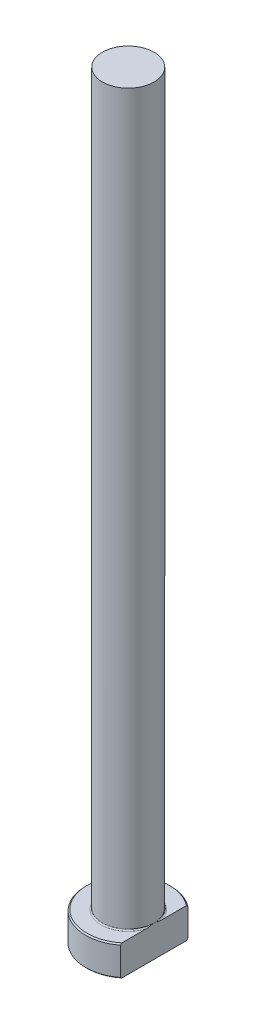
ISO-10303-21;
HEADER;
FILE_DESCRIPTION(('STEP AP214'),'2;1');
FILE_NAME('part.step','',(''),(''),'','','');
FILE_SCHEMA(('AUTOMOTIVE_DESIGN { 1 0 10303 214 1 1 1 1 }'));
ENDSEC;
DATA;
#1=APPLICATION_CONTEXT('core data for automotive mechanical design processes');
#2=APPLICATION_PROTOCOL_DEFINITION('international standard','automotive_design',2000,#1);
#3=PRODUCT_CONTEXT('',#1,'mechanical');
#4=PRODUCT('Part','Part','',(#3));
#5=PRODUCT_RELATED_PRODUCT_CATEGORY('part','',(#4));
#6=PRODUCT_DEFINITION_FORMATION('','',#4);
#7=PRODUCT_DEFINITION_CONTEXT('part definition',#1,'design');
#8=PRODUCT_DEFINITION('design','',#6,#7);
#9=PRODUCT_DEFINITION_SHAPE('','',#8);
#10=(LENGTH_UNIT() NAMED_UNIT(*) SI_UNIT(.MILLI.,.METRE.));
#11=(NAMED_UNIT(*) PLANE_ANGLE_UNIT() SI_UNIT($,.RADIAN.));
#12=(NAMED_UNIT(*) SI_UNIT($,.STERADIAN.) SOLID_ANGLE_UNIT());
#13=UNCERTAINTY_MEASURE_WITH_UNIT(LENGTH_MEASURE(1.E-05),#10,'distance_accuracy_value','');
#14=(GEOMETRIC_REPRESENTATION_CONTEXT(3) GLOBAL_UNCERTAINTY_ASSIGNED_CONTEXT((#13)) GLOBAL_UNIT_ASSIGNED_CONTEXT((#10,
#11,#12)) REPRESENTATION_CONTEXT('',''));
#15=CARTESIAN_POINT('',(0.,0.,0.));
#16=DIRECTION('',(0.,0.,1.));
#17=DIRECTION('',(1.,0.,0.));
#18=AXIS2_PLACEMENT_3D('',#15,#16,#17);
#19=CARTESIAN_POINT('',(0.,0.,0.));
#20=DIRECTION('',(0.,-1.,0.));
#21=DIRECTION('',(0.,0.,-1.));
#22=AXIS2_PLACEMENT_3D('',#19,#20,#21);
#23=PLANE('',#22);
#24=CARTESIAN_POINT('',(0.,0.,0.));
#25=DIRECTION('',(0.,-1.,0.));
#26=DIRECTION('',(0.,0.,-1.));
#27=AXIS2_PLACEMENT_3D('',#24,#25,#26);
#28=CIRCLE('',#27,6.8);
#29=CARTESIAN_POINT('',(4.24999999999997,0.,5.30824829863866));
#30=VERTEX_POINT('',#29);
#31=CARTESIAN_POINT('',(4.24999999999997,0.,-5.30824829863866));
#32=VERTEX_POINT('',#31);
#33=EDGE_CURVE('E98',#30,#32,#28,.T.);
#34=ORIENTED_EDGE('',*,*,#33,.T.);
#35=DIRECTION('',(0.,0.,1.));
#36=VECTOR('',#35,1.);
#37=CARTESIAN_POINT('',(4.24999999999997,0.,-5.56214886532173));
#38=LINE('',#37,#36);
#39=EDGE_CURVE('E83',#32,#30,#38,.T.);
#40=ORIENTED_EDGE('',*,*,#39,.T.);
#41=EDGE_LOOP('',(#34,#40));
#42=FACE_BOUND('',#41,.T.);
#43=ADVANCED_FACE('F32',(#42),#23,.T.);
#44=CARTESIAN_POINT('',(0.,259.958771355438,0.));
#45=DIRECTION('',(0.,1.,0.));
#46=DIRECTION('',(0.,0.,1.));
#47=AXIS2_PLACEMENT_3D('',#44,#45,#46);
#48=CYLINDRICAL_SURFACE('',#47,6.99999999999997);
#49=CARTESIAN_POINT('',(0.,4.80000000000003,0.));
#50=DIRECTION('',(0.,1.,0.));
#51=DIRECTION('',(0.,0.,1.));
#52=AXIS2_PLACEMENT_3D('',#49,#50,#51);
#53=CIRCLE('',#52,6.99999999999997);
#54=CARTESIAN_POINT('',(4.24999999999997,4.80000000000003,5.56214886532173));
#55=VERTEX_POINT('',#54);
#56=CARTESIAN_POINT('',(4.24999999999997,4.80000000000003,-5.56214886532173));
#57=VERTEX_POINT('',#56);
#58=EDGE_CURVE('E104',#55,#57,#53,.F.);
#59=ORIENTED_EDGE('',*,*,#58,.T.);
#60=DIRECTION('',(0.,-1.,0.));
#61=VECTOR('',#60,1.);
#62=CARTESIAN_POINT('',(4.24999999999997,125.,-5.56214886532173));
#63=LINE('',#62,#61);
#64=CARTESIAN_POINT('',(4.24999999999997,0.199999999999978,-5.56214886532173));
#65=VERTEX_POINT('',#64);
#66=EDGE_CURVE('E183',#57,#65,#63,.T.);
#67=ORIENTED_EDGE('',*,*,#66,.T.);
#68=CARTESIAN_POINT('',(0.,0.199999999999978,0.));
#69=DIRECTION('',(0.,-1.,0.));
#70=DIRECTION('',(0.,0.,-1.));
#71=AXIS2_PLACEMENT_3D('',#68,#69,#70);
#72=CIRCLE('',#71,6.99999999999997);
#73=CARTESIAN_POINT('',(4.24999999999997,0.199999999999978,5.56214886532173));
#74=VERTEX_POINT('',#73);
#75=EDGE_CURVE('E100',#65,#74,#72,.F.);
#76=ORIENTED_EDGE('',*,*,#75,.T.);
#77=DIRECTION('',(0.,-1.,0.));
#78=VECTOR('',#77,1.);
#79=CARTESIAN_POINT('',(4.24999999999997,125.,5.56214886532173));
#80=LINE('',#79,#78);
#81=EDGE_CURVE('E93',#55,#74,#80,.T.);
#82=ORIENTED_EDGE('',*,*,#81,.F.);
#83=EDGE_LOOP('',(#59,#67,#76,#82));
#84=FACE_BOUND('',#83,.T.);
#85=ADVANCED_FACE('F158',(#84),#48,.T.);
#86=CARTESIAN_POINT('',(-6.99999999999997,5.,0.));
#87=DIRECTION('',(0.,1.,0.));
#88=DIRECTION('',(0.,0.,1.));
#89=AXIS2_PLACEMENT_3D('',#86,#87,#88);
#90=PLANE('',#89);
#91=CARTESIAN_POINT('',(0.,5.,0.));
#92=DIRECTION('',(0.,1.,0.));
#93=DIRECTION('',(0.,0.,1.));
#94=AXIS2_PLACEMENT_3D('',#91,#92,#93);
#95=CIRCLE('',#94,6.79999999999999);
#96=CARTESIAN_POINT('',(4.24999999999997,5.,-5.30824829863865));
#97=VERTEX_POINT('',#96);
#98=CARTESIAN_POINT('',(4.24999999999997,5.,5.30824829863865));
#99=VERTEX_POINT('',#98);
#100=EDGE_CURVE('E178',#97,#99,#95,.T.);
#101=ORIENTED_EDGE('',*,*,#100,.T.);
#102=DIRECTION('',(0.,0.,-1.));
#103=VECTOR('',#102,1.);
#104=CARTESIAN_POINT('',(4.24999999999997,5.,0.));
#105=LINE('',#104,#103);
#106=CARTESIAN_POINT('',(4.24999999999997,4.99999999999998,1.31909059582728));
#107=VERTEX_POINT('',#106);
#108=EDGE_CURVE('E57',#99,#107,#105,.T.);
#109=ORIENTED_EDGE('',*,*,#108,.T.);
#110=CARTESIAN_POINT('',(0.,5.,0.));
#111=DIRECTION('',(0.,1.,0.));
#112=DIRECTION('',(0.,0.,1.));
#113=AXIS2_PLACEMENT_3D('',#110,#111,#112);
#114=CIRCLE('',#113,4.44999999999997);
#115=CARTESIAN_POINT('',(4.24999999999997,4.99999999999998,-1.31909059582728));
#116=VERTEX_POINT('',#115);
#117=EDGE_CURVE('E107',#107,#116,#114,.F.);
#118=ORIENTED_EDGE('',*,*,#117,.T.);
#119=EDGE_CURVE('E136',#116,#97,#105,.T.);
#120=ORIENTED_EDGE('',*,*,#119,.T.);
#121=EDGE_LOOP('',(#101,#109,#118,#120));
#122=FACE_BOUND('',#121,.T.);
#123=ADVANCED_FACE('F147',(#122),#90,.T.);
#124=CARTESIAN_POINT('',(0.,5.,0.));
#125=DIRECTION('',(0.,-1.,0.));
#126=DIRECTION('',(0.,0.,-1.));
#127=AXIS2_PLACEMENT_3D('',#124,#125,#126);
#128=CONICAL_SURFACE('',#127,6.79999999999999,0.785398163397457);
#129=ORIENTED_EDGE('',*,*,#58,.F.);
#130=CARTESIAN_POINT('',(4.24999999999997,-1.15497179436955,12.2380061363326));
#131=CARTESIAN_POINT('',(4.24999999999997,-0.968600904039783,12.0407126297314));
#132=CARTESIAN_POINT('',(4.24999999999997,-0.782481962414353,11.843180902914));
#133=CARTESIAN_POINT('',(4.24999999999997,-0.410835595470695,11.4475596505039));
#134=CARTESIAN_POINT('',(4.24999999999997,-0.225308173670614,11.2494701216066));
#135=CARTESIAN_POINT('',(4.24999999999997,0.330615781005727,10.6538566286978));
#136=CARTESIAN_POINT('',(4.24999999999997,0.699987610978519,10.2553749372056));
#137=CARTESIAN_POINT('',(4.24999999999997,1.44820689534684,9.44056382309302));
#138=CARTESIAN_POINT('',(4.24999999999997,1.82691721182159,9.02410803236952));
#139=CARTESIAN_POINT('',(4.24999999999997,2.39038838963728,8.39564122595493));
#140=CARTESIAN_POINT('',(4.24999999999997,2.57736390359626,8.1856164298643));
#141=CARTESIAN_POINT('',(4.24999999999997,2.94948531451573,7.76395344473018));
#142=CARTESIAN_POINT('',(4.24999999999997,3.13463122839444,7.55231527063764));
#143=CARTESIAN_POINT('',(4.24999999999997,3.50243810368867,7.12729701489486));
#144=CARTESIAN_POINT('',(4.24999999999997,3.68510158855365,6.91391912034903));
#145=CARTESIAN_POINT('',(4.24999999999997,4.04753998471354,6.48470257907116));
#146=CARTESIAN_POINT('',(4.24999999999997,4.22731476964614,6.26886382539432));
#147=CARTESIAN_POINT('',(4.24999999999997,4.58362310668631,5.83346482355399));
#148=CARTESIAN_POINT('',(4.24999999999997,4.76014565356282,5.61389554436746));
#149=CARTESIAN_POINT('',(4.24999999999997,5.10813954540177,5.1708154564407));
#150=CARTESIAN_POINT('',(4.24999999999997,5.27961153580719,4.94730515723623));
#151=CARTESIAN_POINT('',(4.24999999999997,5.61292794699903,4.49883470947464));
#152=CARTESIAN_POINT('',(4.24999999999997,5.77488381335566,4.27395773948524));
#153=CARTESIAN_POINT('',(4.24999999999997,6.08959034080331,3.81755429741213));
#154=CARTESIAN_POINT('',(4.24999999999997,6.2423352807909,3.58602382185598));
#155=CARTESIAN_POINT('',(4.24999999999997,6.46088242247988,3.2329692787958));
#156=CARTESIAN_POINT('',(4.24999999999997,6.53180994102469,3.11461948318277));
#157=CARTESIAN_POINT('',(4.24999999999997,6.66953191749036,2.87554671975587));
#158=CARTESIAN_POINT('',(4.24999999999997,6.73632692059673,2.7548240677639));
#159=CARTESIAN_POINT('',(4.24999999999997,6.86480050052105,2.51086229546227));
#160=CARTESIAN_POINT('',(4.24999999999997,6.92648531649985,2.38762647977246));
#161=CARTESIAN_POINT('',(4.24999999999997,7.04367856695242,2.13827051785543));
#162=CARTESIAN_POINT('',(4.24999999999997,7.09918867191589,2.0121511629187));
#163=CARTESIAN_POINT('',(4.24999999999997,7.20212054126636,1.75821381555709));
#164=CARTESIAN_POINT('',(4.24999999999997,7.24962333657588,1.63042897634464));
#165=CARTESIAN_POINT('',(4.24999999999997,7.33574687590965,1.37182854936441));
#166=CARTESIAN_POINT('',(4.24999999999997,7.37436534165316,1.24101219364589));
#167=CARTESIAN_POINT('',(4.24999999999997,7.44090399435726,0.977431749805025));
#168=CARTESIAN_POINT('',(4.24999999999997,7.46888314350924,0.844682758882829));
#169=CARTESIAN_POINT('',(4.24999999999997,7.51300819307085,0.577216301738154));
#170=CARTESIAN_POINT('',(4.24999999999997,7.52915548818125,0.44249906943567));
#171=CARTESIAN_POINT('',(4.24999999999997,7.54874331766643,0.170860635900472));
#172=CARTESIAN_POINT('',(4.24999999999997,7.55206380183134,0.0339306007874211));
#173=CARTESIAN_POINT('',(4.24999999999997,7.54544836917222,-0.239598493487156));
#174=CARTESIAN_POINT('',(4.24999999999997,7.53551276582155,-0.376197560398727));
#175=CARTESIAN_POINT('',(4.24999999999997,7.50295253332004,-0.648437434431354));
#176=CARTESIAN_POINT('',(4.24999999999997,7.48027427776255,-0.784071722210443));
#177=CARTESIAN_POINT('',(4.24999999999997,7.42348982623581,-1.05291460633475));
#178=CARTESIAN_POINT('',(4.24999999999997,7.38938084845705,-1.18612260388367));
#179=CARTESIAN_POINT('',(4.24999999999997,7.29188531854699,-1.51531404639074));
#180=CARTESIAN_POINT('',(4.24999999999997,7.2223807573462,-1.70947814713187));
#181=CARTESIAN_POINT('',(4.24999999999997,7.0666874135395,-2.09097599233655));
#182=CARTESIAN_POINT('',(4.24999999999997,6.98048657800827,-2.27830468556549));
#183=CARTESIAN_POINT('',(4.24999999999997,6.84149476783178,-2.55552751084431));
#184=CARTESIAN_POINT('',(4.24999999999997,6.79327931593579,-2.64776502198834));
#185=CARTESIAN_POINT('',(4.24999999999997,6.69413480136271,-2.83077431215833));
#186=CARTESIAN_POINT('',(4.24999999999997,6.64320570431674,-2.92154607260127));
#187=CARTESIAN_POINT('',(4.24999999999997,6.53904474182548,-3.10170103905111));
#188=CARTESIAN_POINT('',(4.24999999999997,6.48581387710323,-3.19108482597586));
#189=CARTESIAN_POINT('',(4.24999999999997,6.37734720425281,-3.36861867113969));
#190=CARTESIAN_POINT('',(4.24999999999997,6.32211148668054,-3.45676878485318));
#191=CARTESIAN_POINT('',(4.24999999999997,6.13027123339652,-3.75631659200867));
#192=CARTESIAN_POINT('',(4.24999999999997,5.9894700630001,-3.96503082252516));
#193=CARTESIAN_POINT('',(4.24999999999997,5.70061349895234,-4.37739745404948));
#194=CARTESIAN_POINT('',(4.24999999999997,5.55255625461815,-4.58104854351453));
#195=CARTESIAN_POINT('',(4.24999999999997,5.25096308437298,-4.98451036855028));
#196=CARTESIAN_POINT('',(4.24999999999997,5.0974225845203,-5.18431767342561));
#197=CARTESIAN_POINT('',(4.24999999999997,4.78630665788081,-5.58072220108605));
#198=CARTESIAN_POINT('',(4.24999999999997,4.62873161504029,-5.77731972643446));
#199=CARTESIAN_POINT('',(4.24999999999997,4.30987074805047,-6.16866624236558));
#200=CARTESIAN_POINT('',(4.24999999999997,4.1485735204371,-6.3634059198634));
#201=CARTESIAN_POINT('',(4.24999999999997,3.82349048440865,-6.75079948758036));
#202=CARTESIAN_POINT('',(4.24999999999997,3.65970462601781,-6.94345333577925));
#203=CARTESIAN_POINT('',(4.24999999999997,3.3302217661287,-7.3269546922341));
#204=CARTESIAN_POINT('',(4.24999999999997,3.1645257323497,-7.51780303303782));
#205=CARTESIAN_POINT('',(4.24999999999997,2.83151234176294,-7.89808083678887));
#206=CARTESIAN_POINT('',(4.24999999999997,2.66419497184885,-8.08751028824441));
#207=CARTESIAN_POINT('',(4.24999999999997,2.19674563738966,-8.6129983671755));
#208=CARTESIAN_POINT('',(4.24999999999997,1.89516668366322,-8.94776953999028));
#209=CARTESIAN_POINT('',(4.24999999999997,1.28890266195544,-9.61456394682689));
#210=CARTESIAN_POINT('',(4.24999999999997,0.984217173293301,-9.9465867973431));
#211=CARTESIAN_POINT('',(4.24999999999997,0.374739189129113,-10.6061264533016));
#212=CARTESIAN_POINT('',(4.24999999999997,0.0699631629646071,-10.9336584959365));
#213=CARTESIAN_POINT('',(4.24999999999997,-0.54131733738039,-11.5870007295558));
#214=CARTESIAN_POINT('',(4.24999999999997,-0.847821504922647,-11.9128112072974));
#215=CARTESIAN_POINT('',(4.24999999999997,-1.15497179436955,-12.2380061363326));
#216=B_SPLINE_CURVE_WITH_KNOTS('',3,(#130,#131,#132,#133,#134,#135,#136,#137,#138,#139,#140,
#141,#142,#143,#144,#145,#146,#147,#148,#149,#150,#151,#152,#153,#154,#155,#156,#157,#158,#159,
#160,#161,#162,#163,#164,#165,#166,#167,#168,#169,#170,#171,#172,#173,#174,#175,#176,#177,#178,
#179,#180,#181,#182,#183,#184,#185,#186,#187,#188,#189,#190,#191,#192,#193,#194,#195,#196,#197,
#198,#199,#200,#201,#202,#203,#204,#205,#206,#207,#208,#209,#210,#211,#212,#213,#214,#215),
.UNSPECIFIED.,.F.,.F.,(4,2,2,2,2,2,2,2,2,2,2,2,2,2,2,2,2,2,2,2,2,2,2,2,2,2,2,2,2,2,2,2,2,2,2,2,
2,2,2,2,2,2,4),(0.,0.814204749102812,1.62841433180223,3.25843263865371,4.94708916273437,
5.79066412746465,6.63423128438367,7.47686481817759,8.31953511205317,9.16466757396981,
10.0096915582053,10.8409260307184,11.6726715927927,12.0865355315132,12.5003447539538,
12.9136410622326,13.3268252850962,13.7355380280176,14.144355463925,14.5508730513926,
14.9573427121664,15.3676075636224,15.7778627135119,16.1898574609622,16.6019525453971,
17.2195383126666,17.8375715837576,18.1497730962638,18.4619785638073,18.7740496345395,
19.0861066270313,19.8411596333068,20.5964062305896,21.352298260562,22.1081186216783,
22.8666854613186,23.6252675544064,24.3834808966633,25.1417003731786,26.4934084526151,
27.8453020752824,29.1874909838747,30.5294487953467),.UNSPECIFIED.);
#217=EDGE_CURVE('E135',#55,#99,#216,.T.);
#218=ORIENTED_EDGE('',*,*,#217,.T.);
#219=ORIENTED_EDGE('',*,*,#100,.F.);
#220=EDGE_CURVE('E127',#97,#57,#216,.T.);
#221=ORIENTED_EDGE('',*,*,#220,.T.);
#222=EDGE_LOOP('',(#129,#218,#219,#221));
#223=FACE_BOUND('',#222,.T.);
#224=ADVANCED_FACE('F143',(#223),#128,.T.);
#225=CARTESIAN_POINT('',(0.,0.199999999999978,0.));
#226=DIRECTION('',(0.,1.,0.));
#227=DIRECTION('',(0.,0.,1.));
#228=AXIS2_PLACEMENT_3D('',#225,#226,#227);
#229=CONICAL_SURFACE('',#228,6.99999999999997,0.785398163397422);
#230=ORIENTED_EDGE('',*,*,#75,.F.);
#231=CARTESIAN_POINT('',(4.24999999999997,6.15497179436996,-12.2380061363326));
#232=CARTESIAN_POINT('',(4.24999999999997,5.96860090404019,-12.0407126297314));
#233=CARTESIAN_POINT('',(4.24999999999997,5.78248196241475,-11.843180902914));
#234=CARTESIAN_POINT('',(4.24999999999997,5.41083559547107,-11.4475596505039));
#235=CARTESIAN_POINT('',(4.24999999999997,5.22530817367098,-11.2494701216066));
#236=CARTESIAN_POINT('',(4.24999999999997,4.66938421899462,-10.6538566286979));
#237=CARTESIAN_POINT('',(4.24999999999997,4.3000123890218,-10.2553749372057));
#238=CARTESIAN_POINT('',(4.24999999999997,3.55179310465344,-9.44056382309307));
#239=CARTESIAN_POINT('',(4.24999999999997,3.17308278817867,-9.02410803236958));
#240=CARTESIAN_POINT('',(4.24999999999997,2.60961161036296,-8.39564122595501));
#241=CARTESIAN_POINT('',(4.24999999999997,2.42263609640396,-8.18561642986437));
#242=CARTESIAN_POINT('',(4.24999999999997,2.05051468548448,-7.76395344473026));
#243=CARTESIAN_POINT('',(4.24999999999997,1.86536877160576,-7.55231527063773));
#244=CARTESIAN_POINT('',(4.24999999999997,1.49756189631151,-7.12729701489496));
#245=CARTESIAN_POINT('',(4.24999999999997,1.31489841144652,-6.91391912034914));
#246=CARTESIAN_POINT('',(4.24999999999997,0.95246001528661,-6.48470257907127));
#247=CARTESIAN_POINT('',(4.24999999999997,0.772685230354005,-6.26886382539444));
#248=CARTESIAN_POINT('',(4.24999999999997,0.416376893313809,-5.83346482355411));
#249=CARTESIAN_POINT('',(4.24999999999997,0.239854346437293,-5.61389554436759));
#250=CARTESIAN_POINT('',(4.24999999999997,-0.108139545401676,-5.17081545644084));
#251=CARTESIAN_POINT('',(4.24999999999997,-0.279611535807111,-4.94730515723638));
#252=CARTESIAN_POINT('',(4.24999999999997,-0.612927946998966,-4.49883470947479));
#253=CARTESIAN_POINT('',(4.24999999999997,-0.77488381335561,-4.2739577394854));
#254=CARTESIAN_POINT('',(4.24999999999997,-1.08959034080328,-3.8175542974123));
#255=CARTESIAN_POINT('',(4.24999999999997,-1.24233528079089,-3.58602382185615));
#256=CARTESIAN_POINT('',(4.24999999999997,-1.46088242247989,-3.23296927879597));
#257=CARTESIAN_POINT('',(4.24999999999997,-1.5318099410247,-3.11461948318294));
#258=CARTESIAN_POINT('',(4.24999999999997,-1.66953191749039,-2.87554671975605));
#259=CARTESIAN_POINT('',(4.24999999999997,-1.73632692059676,-2.75482406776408));
#260=CARTESIAN_POINT('',(4.24999999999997,-1.8648005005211,-2.51086229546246));
#261=CARTESIAN_POINT('',(4.24999999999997,-1.92648531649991,-2.38762647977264));
#262=CARTESIAN_POINT('',(4.24999999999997,-2.04367856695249,-2.13827051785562));
#263=CARTESIAN_POINT('',(4.24999999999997,-2.09918867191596,-2.0121511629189));
#264=CARTESIAN_POINT('',(4.24999999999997,-2.20212054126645,-1.75821381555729));
#265=CARTESIAN_POINT('',(4.24999999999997,-2.24962333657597,-1.63042897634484));
#266=CARTESIAN_POINT('',(4.24999999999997,-2.33574687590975,-1.37182854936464));
#267=CARTESIAN_POINT('',(4.24999999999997,-2.37436534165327,-1.24101219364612));
#268=CARTESIAN_POINT('',(4.24999999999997,-2.44090399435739,-0.977431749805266));
#269=CARTESIAN_POINT('',(4.24999999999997,-2.46888314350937,-0.844682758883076));
#270=CARTESIAN_POINT('',(4.24999999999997,-2.51300819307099,-0.577216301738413));
#271=CARTESIAN_POINT('',(4.24999999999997,-2.52915548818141,-0.442499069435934));
#272=CARTESIAN_POINT('',(4.24999999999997,-2.54874331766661,-0.170860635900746));
#273=CARTESIAN_POINT('',(4.24999999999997,-2.55206380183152,-0.0339306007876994));
#274=CARTESIAN_POINT('',(4.24999999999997,-2.54544836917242,0.23959849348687));
#275=CARTESIAN_POINT('',(4.24999999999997,-2.53551276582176,0.376197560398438));
#276=CARTESIAN_POINT('',(4.24999999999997,-2.50295253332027,0.64843743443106));
#277=CARTESIAN_POINT('',(4.24999999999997,-2.48027427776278,0.784071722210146));
#278=CARTESIAN_POINT('',(4.24999999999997,-2.42348982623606,1.05291460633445));
#279=CARTESIAN_POINT('',(4.24999999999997,-2.3893808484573,1.18612260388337));
#280=CARTESIAN_POINT('',(4.24999999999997,-2.29188531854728,1.5153140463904));
#281=CARTESIAN_POINT('',(4.24999999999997,-2.2223807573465,1.70947814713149));
#282=CARTESIAN_POINT('',(4.24999999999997,-2.06668741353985,2.0909759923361));
#283=CARTESIAN_POINT('',(4.24999999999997,-1.98048657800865,2.278304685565));
#284=CARTESIAN_POINT('',(4.24999999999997,-1.84149476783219,2.55552751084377));
#285=CARTESIAN_POINT('',(4.24999999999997,-1.79327931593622,2.64776502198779));
#286=CARTESIAN_POINT('',(4.24999999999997,-1.69413480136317,2.83077431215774));
#287=CARTESIAN_POINT('',(4.24999999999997,-1.64320570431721,2.92154607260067));
#288=CARTESIAN_POINT('',(4.24999999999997,-1.53904474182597,3.10170103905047));
#289=CARTESIAN_POINT('',(4.24999999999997,-1.48581387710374,3.19108482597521));
#290=CARTESIAN_POINT('',(4.24999999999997,-1.37734720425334,3.368618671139));
#291=CARTESIAN_POINT('',(4.24999999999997,-1.32211148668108,3.45676878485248));
#292=CARTESIAN_POINT('',(4.24999999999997,-1.13027123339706,3.75631659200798));
#293=CARTESIAN_POINT('',(4.24999999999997,-0.989470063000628,3.9650308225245));
#294=CARTESIAN_POINT('',(4.24999999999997,-0.700613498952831,4.37739745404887));
#295=CARTESIAN_POINT('',(4.24999999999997,-0.552556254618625,4.58104854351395));
#296=CARTESIAN_POINT('',(4.24999999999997,-0.25096308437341,4.98451036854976));
#297=CARTESIAN_POINT('',(4.24999999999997,-0.097422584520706,5.1843176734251));
#298=CARTESIAN_POINT('',(4.24999999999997,0.213693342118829,5.58072220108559));
#299=CARTESIAN_POINT('',(4.24999999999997,0.371268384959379,5.77731972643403));
#300=CARTESIAN_POINT('',(4.24999999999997,0.690129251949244,6.1686662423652));
#301=CARTESIAN_POINT('',(4.24999999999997,0.851426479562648,6.36340591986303));
#302=CARTESIAN_POINT('',(4.24999999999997,1.17650951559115,6.75079948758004));
#303=CARTESIAN_POINT('',(4.24999999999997,1.34029537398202,6.94345333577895));
#304=CARTESIAN_POINT('',(4.24999999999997,1.66977823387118,7.32695469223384));
#305=CARTESIAN_POINT('',(4.24999999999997,1.83547426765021,7.51780303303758));
#306=CARTESIAN_POINT('',(4.24999999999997,2.16848765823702,7.89808083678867));
#307=CARTESIAN_POINT('',(4.24999999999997,2.33580502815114,8.08751028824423));
#308=CARTESIAN_POINT('',(4.24999999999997,2.8032543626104,8.61299836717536));
#309=CARTESIAN_POINT('',(4.24999999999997,3.10483331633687,8.94776953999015));
#310=CARTESIAN_POINT('',(4.24999999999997,3.71109733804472,9.61456394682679));
#311=CARTESIAN_POINT('',(4.24999999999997,4.01578282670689,9.94658679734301));
#312=CARTESIAN_POINT('',(4.24999999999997,4.62526081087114,10.6061264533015));
#313=CARTESIAN_POINT('',(4.24999999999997,4.93003683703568,10.9336584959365));
#314=CARTESIAN_POINT('',(4.24999999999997,5.54131733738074,11.5870007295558));
#315=CARTESIAN_POINT('',(4.24999999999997,5.84782150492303,11.9128112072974));
#316=CARTESIAN_POINT('',(4.24999999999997,6.15497179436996,12.2380061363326));
#317=B_SPLINE_CURVE_WITH_KNOTS('',3,(#231,#232,#233,#234,#235,#236,#237,#238,#239,#240,#241,
#242,#243,#244,#245,#246,#247,#248,#249,#250,#251,#252,#253,#254,#255,#256,#257,#258,#259,#260,
#261,#262,#263,#264,#265,#266,#267,#268,#269,#270,#271,#272,#273,#274,#275,#276,#277,#278,#279,
#280,#281,#282,#283,#284,#285,#286,#287,#288,#289,#290,#291,#292,#293,#294,#295,#296,#297,#298,
#299,#300,#301,#302,#303,#304,#305,#306,#307,#308,#309,#310,#311,#312,#313,#314,#315,#316),
.UNSPECIFIED.,.F.,.F.,(4,2,2,2,2,2,2,2,2,2,2,2,2,2,2,2,2,2,2,2,2,2,2,2,2,2,2,2,2,2,2,2,2,2,2,2,
2,2,2,2,2,2,4),(0.,0.814204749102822,1.62841433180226,3.25843263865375,4.94708916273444,
5.79066412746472,6.63423128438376,7.47686481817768,8.31953511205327,9.16466757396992,
10.0096915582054,10.8409260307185,11.6726715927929,12.0865355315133,12.500344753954,
12.9136410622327,13.3268252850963,13.7355380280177,14.1443554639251,14.5508730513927,
14.9573427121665,15.3676075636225,15.777862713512,16.1898574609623,16.6019525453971,
17.2195383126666,17.8375715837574,18.1497730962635,18.461978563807,18.7740496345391,
19.0861066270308,19.8411596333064,20.5964062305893,21.3522982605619,22.1081186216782,
22.8666854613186,23.6252675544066,24.3834808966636,25.141700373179,26.4934084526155,
27.845302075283,29.1874909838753,30.5294487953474),.UNSPECIFIED.);
#318=EDGE_CURVE('E86',#65,#32,#317,.T.);
#319=ORIENTED_EDGE('',*,*,#318,.T.);
#320=ORIENTED_EDGE('',*,*,#33,.F.);
#321=EDGE_CURVE('E89',#30,#74,#317,.T.);
#322=ORIENTED_EDGE('',*,*,#321,.T.);
#323=EDGE_LOOP('',(#230,#319,#320,#322));
#324=FACE_BOUND('',#323,.T.);
#325=ADVANCED_FACE('F97',(#324),#229,.T.);
#326=CARTESIAN_POINT('',(0.,5.19999999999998,0.));
#327=DIRECTION('',(0.,1.,0.));
#328=DIRECTION('',(0.,0.,1.));
#329=AXIS2_PLACEMENT_3D('',#326,#327,#328);
#330=TOROIDAL_SURFACE('',#329,4.44999999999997,0.2);
#331=CARTESIAN_POINT('',(4.24999999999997,5.19999999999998,0.));
#332=CARTESIAN_POINT('',(4.24999999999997,5.20000051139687,1.15744821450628E-10));
#333=CARTESIAN_POINT('',(4.24999999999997,5.20000102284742,-2.4293169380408E-07));
#334=CARTESIAN_POINT('',(4.24999999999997,5.20000197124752,-8.87321860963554E-07));
#335=CARTESIAN_POINT('',(4.24999999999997,5.20000238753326,-1.30614850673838E-06));
#336=CARTESIAN_POINT('',(4.24999999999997,5.20000327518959,-2.31752643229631E-06));
#337=CARTESIAN_POINT('',(4.24999999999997,5.20000373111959,-2.92646131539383E-06));
#338=CARTESIAN_POINT('',(4.24999999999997,5.200004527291,-4.16981951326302E-06));
#339=CARTESIAN_POINT('',(4.24999999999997,5.2000048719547,-4.80170872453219E-06));
#340=CARTESIAN_POINT('',(4.24999999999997,5.20000620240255,-7.3194814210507E-06));
#341=CARTESIAN_POINT('',(4.24999999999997,5.20000712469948,-9.24257745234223E-06));
#342=CARTESIAN_POINT('',(4.24999999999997,5.20000859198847,-1.29952261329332E-05));
#343=CARTESIAN_POINT('',(4.24999999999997,5.20000916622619,-1.48137375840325E-05));
#344=CARTESIAN_POINT('',(4.24999999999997,5.20001166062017,-2.2701068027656E-05));
#345=CARTESIAN_POINT('',(4.24999999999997,5.20001358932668,-2.87689532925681E-05));
#346=CARTESIAN_POINT('',(4.24999999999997,5.20001634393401,-4.00958698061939E-05));
#347=CARTESIAN_POINT('',(4.24999999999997,5.20001729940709,-4.53228601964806E-05));
#348=CARTESIAN_POINT('',(4.24999999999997,5.20002438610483,-8.47086375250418E-05));
#349=CARTESIAN_POINT('',(4.24999999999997,5.20002990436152,-0.000118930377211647));
#350=CARTESIAN_POINT('',(4.24999999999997,5.20005405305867,-0.000255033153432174));
#351=CARTESIAN_POINT('',(4.24999999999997,5.20007694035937,-0.00035616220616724));
#352=CARTESIAN_POINT('',(4.24999999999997,5.20016675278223,-0.000759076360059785));
#353=CARTESIAN_POINT('',(4.24999999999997,5.20023104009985,-0.00106124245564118));
#354=CARTESIAN_POINT('',(4.24999999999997,5.20048990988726,-0.00226975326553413));
#355=CARTESIAN_POINT('',(4.24999999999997,5.20068789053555,-0.00317558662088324));
#356=CARTESIAN_POINT('',(4.24999999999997,5.20151472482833,-0.00696787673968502));
#357=CARTESIAN_POINT('',(4.24999999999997,5.2021393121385,-0.00985497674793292));
#358=CARTESIAN_POINT('',(4.24999999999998,5.21047485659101,-0.0483744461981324));
#359=CARTESIAN_POINT('',(4.24999999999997,5.21821166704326,-0.0840032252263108));
#360=CARTESIAN_POINT('',(4.24999999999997,5.23443934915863,-0.15925743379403));
#361=CARTESIAN_POINT('',(4.24999999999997,5.24291807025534,-0.198885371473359));
#362=CARTESIAN_POINT('',(4.24999999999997,5.25719269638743,-0.266483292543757));
#363=CARTESIAN_POINT('',(4.24999999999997,5.2630418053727,-0.294441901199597));
#364=CARTESIAN_POINT('',(4.24999999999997,5.27443459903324,-0.349631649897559));
#365=CARTESIAN_POINT('',(4.24999999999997,5.27998226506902,-0.37686197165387));
#366=CARTESIAN_POINT('',(4.24999999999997,5.29789349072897,-0.466265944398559));
#367=CARTESIAN_POINT('',(4.24999999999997,5.3098841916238,-0.528515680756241));
#368=CARTESIAN_POINT('',(4.24999999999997,5.33255488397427,-0.653873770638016));
#369=CARTESIAN_POINT('',(4.24999999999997,5.34322118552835,-0.716984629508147));
#370=CARTESIAN_POINT('',(4.24999999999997,5.36341886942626,-0.849542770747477));
#371=CARTESIAN_POINT('',(4.24999999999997,5.37274606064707,-0.919022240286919));
#372=CARTESIAN_POINT('',(4.24999999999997,5.38787342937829,-1.05816998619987));
#373=CARTESIAN_POINT('',(4.24999999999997,5.39368393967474,-1.12783709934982));
#374=CARTESIAN_POINT('',(4.24999999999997,5.40022105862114,-1.26519903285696));
#375=CARTESIAN_POINT('',(4.24999999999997,5.40110718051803,-1.33288413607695));
#376=CARTESIAN_POINT('',(4.24999999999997,5.39715260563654,-1.43372383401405));
#377=CARTESIAN_POINT('',(4.24999999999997,5.39498924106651,-1.46697561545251));
#378=CARTESIAN_POINT('',(4.24999999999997,5.38843757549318,-1.53323057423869));
#379=CARTESIAN_POINT('',(4.24999999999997,5.38405165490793,-1.56623397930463));
#380=CARTESIAN_POINT('',(4.24999999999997,5.37221191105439,-1.63225744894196));
#381=CARTESIAN_POINT('',(4.24999999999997,5.36471302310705,-1.665270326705));
#382=CARTESIAN_POINT('',(4.24999999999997,5.35002141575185,-1.71373529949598));
#383=CARTESIAN_POINT('',(4.24999999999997,5.3445543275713,-1.72970598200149));
#384=CARTESIAN_POINT('',(4.24999999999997,5.33212858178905,-1.76104662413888));
#385=CARTESIAN_POINT('',(4.24999999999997,5.32517291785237,-1.77641771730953));
#386=CARTESIAN_POINT('',(4.24999999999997,5.31157493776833,-1.80173413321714));
#387=CARTESIAN_POINT('',(4.24999999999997,5.30543892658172,-1.81194868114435));
#388=CARTESIAN_POINT('',(4.24999999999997,5.29187259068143,-1.83147712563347));
#389=CARTESIAN_POINT('',(4.24999999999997,5.28444659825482,-1.84079387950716));
#390=CARTESIAN_POINT('',(4.24999999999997,5.27165788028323,-1.8539962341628));
#391=CARTESIAN_POINT('',(4.24999999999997,5.26687308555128,-1.85843752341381));
#392=CARTESIAN_POINT('',(4.24999999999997,5.25674280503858,-1.86663816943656));
#393=CARTESIAN_POINT('',(4.24999999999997,5.25139780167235,-1.87039810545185));
#394=CARTESIAN_POINT('',(4.24999999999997,5.24121545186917,-1.87633128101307));
#395=CARTESIAN_POINT('',(4.24999999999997,5.23647607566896,-1.87867040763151));
#396=CARTESIAN_POINT('',(4.24999999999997,5.22667692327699,-1.88254109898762));
#397=CARTESIAN_POINT('',(4.24999999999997,5.22161755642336,-1.88407367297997));
#398=CARTESIAN_POINT('',(4.24999999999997,5.21125115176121,-1.88618376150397));
#399=CARTESIAN_POINT('',(4.24999999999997,5.20594232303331,-1.8867527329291));
#400=CARTESIAN_POINT('',(4.24999999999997,5.1953165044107,-1.88683483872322));
#401=CARTESIAN_POINT('',(4.24999999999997,5.18999951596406,-1.88634814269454));
#402=CARTESIAN_POINT('',(4.24999999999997,5.18024254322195,-1.88451305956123));
#403=CARTESIAN_POINT('',(4.24999999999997,5.17577879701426,-1.88328567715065));
#404=CARTESIAN_POINT('',(4.24999999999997,5.16708370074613,-1.88018632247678));
#405=CARTESIAN_POINT('',(4.24999999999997,5.16285244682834,-1.87831408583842));
#406=CARTESIAN_POINT('',(4.24999999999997,5.15236530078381,-1.8728422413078));
#407=CARTESIAN_POINT('',(4.24999999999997,5.14630821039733,-1.86886321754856));
#408=CARTESIAN_POINT('',(4.24999999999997,5.13488065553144,-1.8600173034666));
#409=CARTESIAN_POINT('',(4.24999999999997,5.12951236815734,-1.85514771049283));
#410=CARTESIAN_POINT('',(4.24999999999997,5.11550691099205,-1.84083719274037));
#411=CARTESIAN_POINT('',(4.24999999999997,5.10752788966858,-1.83075903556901));
#412=CARTESIAN_POINT('',(4.24999999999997,5.09305704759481,-1.80961650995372));
#413=CARTESIAN_POINT('',(4.24999999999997,5.08656786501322,-1.7985504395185));
#414=CARTESIAN_POINT('',(4.24999999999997,5.07270261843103,-1.77195183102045));
#415=CARTESIAN_POINT('',(4.24999999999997,5.06578110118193,-1.75618509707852));
#416=CARTESIAN_POINT('',(4.24999999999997,5.05343494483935,-1.72406513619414));
#417=CARTESIAN_POINT('',(4.24999999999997,5.04801326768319,-1.70771081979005));
#418=CARTESIAN_POINT('',(4.24999999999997,5.03828568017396,-1.67446840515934));
#419=CARTESIAN_POINT('',(4.24999999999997,5.03399373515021,-1.65757628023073));
#420=CARTESIAN_POINT('',(4.24999999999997,5.02638165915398,-1.62359857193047));
#421=CARTESIAN_POINT('',(4.24999999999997,5.02306049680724,-1.60651321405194));
#422=CARTESIAN_POINT('',(4.24999999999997,5.01554103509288,-1.56237813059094));
#423=CARTESIAN_POINT('',(4.24999999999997,5.01193061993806,-1.53522860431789));
#424=CARTESIAN_POINT('',(4.24999999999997,5.00624732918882,-1.48076491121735));
#425=CARTESIAN_POINT('',(4.24999999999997,5.00417529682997,-1.45345066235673));
#426=CARTESIAN_POINT('',(4.24999999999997,4.99980704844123,-1.37123328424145));
#427=CARTESIAN_POINT('',(4.24999999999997,4.99938405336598,-1.31623108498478));
#428=CARTESIAN_POINT('',(4.24999999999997,5.00195512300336,-1.20937484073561));
#429=CARTESIAN_POINT('',(4.24999999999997,5.00476235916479,-1.15751417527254));
#430=CARTESIAN_POINT('',(4.24999999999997,5.01274020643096,-1.05395255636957));
#431=CARTESIAN_POINT('',(4.24999999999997,5.0179120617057,-1.00225170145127));
#432=CARTESIAN_POINT('',(4.24999999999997,5.0318667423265,-0.883772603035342));
#433=CARTESIAN_POINT('',(4.24999999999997,5.04126554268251,-0.817068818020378));
#434=CARTESIAN_POINT('',(4.24999999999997,5.06248695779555,-0.68230638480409));
#435=CARTESIAN_POINT('',(4.24999999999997,5.0743654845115,-0.614256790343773));
#436=CARTESIAN_POINT('',(4.24999999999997,5.09582131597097,-0.499048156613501));
#437=CARTESIAN_POINT('',(4.24999999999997,5.10500357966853,-0.451814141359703));
#438=CARTESIAN_POINT('',(4.24999999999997,5.1237965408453,-0.357991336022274));
#439=CARTESIAN_POINT('',(4.24999999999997,5.13340116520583,-0.311401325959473));
#440=CARTESIAN_POINT('',(4.24999999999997,5.15180561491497,-0.223687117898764));
#441=CARTESIAN_POINT('',(4.24999999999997,5.16056968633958,-0.182555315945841));
#442=CARTESIAN_POINT('',(4.24999999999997,5.178640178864,-0.0985301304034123));
#443=CARTESIAN_POINT('',(4.24999999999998,5.18795357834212,-0.0556381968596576));
#444=CARTESIAN_POINT('',(4.24999999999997,5.1978622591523,-0.00984762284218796));
#445=CARTESIAN_POINT('',(4.24999999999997,5.19848844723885,-0.00695317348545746));
#446=CARTESIAN_POINT('',(4.24999999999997,5.1993156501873,-0.00315924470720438));
#447=CARTESIAN_POINT('',(4.24999999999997,5.19951238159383,-0.00225911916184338));
#448=CARTESIAN_POINT('',(4.24999999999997,5.19976973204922,-0.00105770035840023));
#449=CARTESIAN_POINT('',(4.24999999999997,5.19983372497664,-0.000756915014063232));
#450=CARTESIAN_POINT('',(4.24999999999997,5.19992318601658,-0.000355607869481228));
#451=CARTESIAN_POINT('',(4.24999999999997,5.19994602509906,-0.000254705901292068));
#452=CARTESIAN_POINT('',(4.24999999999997,5.1999701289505,-0.000118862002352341));
#453=CARTESIAN_POINT('',(4.24999999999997,5.19997564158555,-8.4670569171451E-05));
#454=CARTESIAN_POINT('',(4.24999999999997,5.19998271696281,-4.53159337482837E-05));
#455=CARTESIAN_POINT('',(4.24999999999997,5.19998367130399,-4.00904844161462E-05));
#456=CARTESIAN_POINT('',(4.24999999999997,5.19998642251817,-2.87668536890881E-05));
#457=CARTESIAN_POINT('',(4.24999999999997,5.19998834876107,-2.27006335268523E-05));
#458=CARTESIAN_POINT('',(4.24999999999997,5.19999084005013,-1.48150638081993E-05));
#459=CARTESIAN_POINT('',(4.24999999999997,5.199991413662,-1.29966656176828E-05));
#460=CARTESIAN_POINT('',(4.24999999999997,5.19999287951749,-9.24415318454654E-06));
#461=CARTESIAN_POINT('',(4.24999999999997,5.19999380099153,-7.32106390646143E-06));
#462=CARTESIAN_POINT('',(4.24999999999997,5.19999513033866,-4.8031966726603E-06));
#463=CARTESIAN_POINT('',(4.24999999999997,5.19999547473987,-4.17124743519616E-06));
#464=CARTESIAN_POINT('',(4.24999999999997,5.19999627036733,-2.92772184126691E-06));
#465=CARTESIAN_POINT('',(4.24999999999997,5.19999672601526,-2.31867707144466E-06));
#466=CARTESIAN_POINT('',(4.24999999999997,5.19999761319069,-1.30704757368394E-06));
#467=CARTESIAN_POINT('',(4.24999999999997,5.19999802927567,-8.88090030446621E-07));
#468=CARTESIAN_POINT('',(4.24999999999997,5.19999897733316,-2.43359811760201E-07));
#469=CARTESIAN_POINT('',(4.24999999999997,5.19999948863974,-1.15736528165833E-10));
#470=CARTESIAN_POINT('',(4.24999999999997,5.19999999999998,0.));
#471=B_SPLINE_CURVE_WITH_KNOTS('',3,(#331,#332,#333,#334,#335,#336,#337,#338,#339,#340,#341,
#342,#343,#344,#345,#346,#347,#348,#349,#350,#351,#352,#353,#354,#355,#356,#357,#358,#359,#360,
#361,#362,#363,#364,#365,#366,#367,#368,#369,#370,#371,#372,#373,#374,#375,#376,#377,#378,#379,
#380,#381,#382,#383,#384,#385,#386,#387,#388,#389,#390,#391,#392,#393,#394,#395,#396,#397,#398,
#399,#400,#401,#402,#403,#404,#405,#406,#407,#408,#409,#410,#411,#412,#413,#414,#415,#416,#417,
#418,#419,#420,#421,#422,#423,#424,#425,#426,#427,#428,#429,#430,#431,#432,#433,#434,#435,#436,
#437,#438,#439,#440,#441,#442,#443,#444,#445,#446,#447,#448,#449,#450,#451,#452,#453,#454,#455,
#456,#457,#458,#459,#460,#461,#462,#463,#464,#465,#466,#467,#468,#469,#470),.UNSPECIFIED.,.T.,
.F.,(4,2,2,2,2,2,2,2,2,2,2,2,2,2,2,2,2,2,2,2,2,2,2,2,2,2,2,2,2,2,2,2,2,2,2,2,2,2,2,2,2,2,2,2,2,
2,2,2,2,2,2,2,2,2,2,2,2,2,2,2,2,2,2,2,2,2,2,2,2,4),(0.,1.56348638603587E-06,
3.34736003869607E-06,5.61252474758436E-06,7.7714730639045E-06,1.41498338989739E-05,
1.98654803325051E-05,3.89412506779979E-05,5.48646730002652E-05,0.000158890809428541,
0.000469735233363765,0.00139675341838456,0.00417812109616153,0.0130401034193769,
0.122414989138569,0.243989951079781,0.329681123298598,0.413050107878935,0.603220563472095,
0.795216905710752,1.00545960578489,1.21508152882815,1.41787186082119,1.51777979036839,
1.61758094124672,1.71888023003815,1.76947366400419,1.81996629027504,1.85565144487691,
1.89121899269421,1.91076085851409,1.93028603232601,1.94608264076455,1.9618594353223,
1.97777538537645,1.99368877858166,2.00752120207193,2.02135930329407,2.04297559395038,
2.06465860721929,2.10300421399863,2.14141720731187,2.19295510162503,2.24459405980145,
2.29684419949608,2.34903862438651,2.43114134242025,2.51328903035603,2.67811431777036,
2.83386590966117,2.98969954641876,3.19173551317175,3.39894587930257,3.54329728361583,
3.68600406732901,3.81216982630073,3.94384090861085,3.95272545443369,3.9554892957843,
3.9564120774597,3.95672222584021,3.95682615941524,3.95684207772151,3.95686114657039,
3.95686686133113,3.9568732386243,3.95687539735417,3.95687766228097,3.95687944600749,
3.95688100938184),.UNSPECIFIED.);
#472=CARTESIAN_POINT('',(4.24999999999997,5.19999999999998,0.));
#473=VERTEX_POINT('',#472);
#474=EDGE_CURVE('E11',#116,#473,#471,.T.);
#475=ORIENTED_EDGE('',*,*,#474,.F.);
#476=ORIENTED_EDGE('',*,*,#117,.F.);
#477=CARTESIAN_POINT('',(4.24999999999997,5.19999999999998,0.));
#478=CARTESIAN_POINT('',(4.24999999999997,5.1999994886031,-1.15744598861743E-10));
#479=CARTESIAN_POINT('',(4.24999999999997,5.19999897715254,2.42931693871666E-07));
#480=CARTESIAN_POINT('',(4.24999999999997,5.19999802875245,8.87321860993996E-07));
#481=CARTESIAN_POINT('',(4.24999999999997,5.1999976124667,1.30614850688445E-06));
#482=CARTESIAN_POINT('',(4.24999999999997,5.19999672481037,2.31752643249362E-06));
#483=CARTESIAN_POINT('',(4.24999999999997,5.19999626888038,2.92646131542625E-06));
#484=CARTESIAN_POINT('',(4.24999999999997,5.19999547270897,4.16981951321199E-06));
#485=CARTESIAN_POINT('',(4.24999999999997,5.19999512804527,4.8017087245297E-06));
#486=CARTESIAN_POINT('',(4.24999999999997,5.19999379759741,7.31948142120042E-06));
#487=CARTESIAN_POINT('',(4.24999999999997,5.19999287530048,9.24257745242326E-06));
#488=CARTESIAN_POINT('',(4.24999999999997,5.1999914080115,1.29952261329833E-05));
#489=CARTESIAN_POINT('',(4.24999999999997,5.19999083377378,1.48137375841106E-05));
#490=CARTESIAN_POINT('',(4.24999999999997,5.19998833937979,2.27010680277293E-05));
#491=CARTESIAN_POINT('',(4.24999999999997,5.19998641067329,2.87689532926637E-05));
#492=CARTESIAN_POINT('',(4.24999999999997,5.19998365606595,4.00958698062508E-05));
#493=CARTESIAN_POINT('',(4.24999999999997,5.19998270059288,4.53228601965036E-05));
#494=CARTESIAN_POINT('',(4.24999999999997,5.19997561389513,8.47086375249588E-05));
#495=CARTESIAN_POINT('',(4.24999999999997,5.19997009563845,0.000118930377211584));
#496=CARTESIAN_POINT('',(4.24999999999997,5.19994594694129,0.000255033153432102));
#497=CARTESIAN_POINT('',(4.24999999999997,5.1999230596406,0.000356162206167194));
#498=CARTESIAN_POINT('',(4.24999999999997,5.19983324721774,0.000759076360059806));
#499=CARTESIAN_POINT('',(4.24999999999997,5.19976895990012,0.00106124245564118));
#500=CARTESIAN_POINT('',(4.24999999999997,5.19951009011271,0.00226975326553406));
#501=CARTESIAN_POINT('',(4.24999999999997,5.19931210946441,0.00317558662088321));
#502=CARTESIAN_POINT('',(4.24999999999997,5.19848527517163,0.00696787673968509));
#503=CARTESIAN_POINT('',(4.24999999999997,5.19786068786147,0.00985497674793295));
#504=CARTESIAN_POINT('',(4.24999999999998,5.18952514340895,0.0483744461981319));
#505=CARTESIAN_POINT('',(4.24999999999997,5.1817883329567,0.0840032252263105));
#506=CARTESIAN_POINT('',(4.24999999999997,5.16556065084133,0.15925743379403));
#507=CARTESIAN_POINT('',(4.24999999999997,5.15708192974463,0.198885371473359));
#508=CARTESIAN_POINT('',(4.24999999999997,5.14280730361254,0.266483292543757));
#509=CARTESIAN_POINT('',(4.24999999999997,5.13695819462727,0.294441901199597));
#510=CARTESIAN_POINT('',(4.24999999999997,5.12556540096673,0.349631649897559));
#511=CARTESIAN_POINT('',(4.24999999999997,5.12001773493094,0.37686197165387));
#512=CARTESIAN_POINT('',(4.24999999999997,5.10210650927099,0.466265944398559));
#513=CARTESIAN_POINT('',(4.24999999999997,5.09011580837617,0.528515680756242));
#514=CARTESIAN_POINT('',(4.24999999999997,5.0674451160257,0.653873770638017));
#515=CARTESIAN_POINT('',(4.24999999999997,5.05677881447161,0.716984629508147));
#516=CARTESIAN_POINT('',(4.24999999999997,5.0365811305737,0.849542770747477));
#517=CARTESIAN_POINT('',(4.24999999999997,5.0272539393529,0.919022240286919));
#518=CARTESIAN_POINT('',(4.24999999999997,5.01212657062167,1.05816998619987));
#519=CARTESIAN_POINT('',(4.24999999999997,5.00631606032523,1.12783709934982));
#520=CARTESIAN_POINT('',(4.24999999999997,4.99977894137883,1.26519903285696));
#521=CARTESIAN_POINT('',(4.24999999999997,4.99889281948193,1.33288413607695));
#522=CARTESIAN_POINT('',(4.24999999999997,5.00284739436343,1.43372383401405));
#523=CARTESIAN_POINT('',(4.24999999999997,5.00501075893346,1.46697561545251));
#524=CARTESIAN_POINT('',(4.24999999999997,5.01156242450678,1.53323057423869));
#525=CARTESIAN_POINT('',(4.24999999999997,5.01594834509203,1.56623397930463));
#526=CARTESIAN_POINT('',(4.24999999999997,5.02778808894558,1.63225744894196));
#527=CARTESIAN_POINT('',(4.24999999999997,5.03528697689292,1.665270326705));
#528=CARTESIAN_POINT('',(4.24999999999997,5.04997858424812,1.71373529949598));
#529=CARTESIAN_POINT('',(4.24999999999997,5.05544567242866,1.72970598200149));
#530=CARTESIAN_POINT('',(4.24999999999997,5.06787141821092,1.76104662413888));
#531=CARTESIAN_POINT('',(4.24999999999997,5.0748270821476,1.77641771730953));
#532=CARTESIAN_POINT('',(4.24999999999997,5.08842506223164,1.80173413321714));
#533=CARTESIAN_POINT('',(4.24999999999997,5.09456107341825,1.81194868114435));
#534=CARTESIAN_POINT('',(4.24999999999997,5.10812740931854,1.83147712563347));
#535=CARTESIAN_POINT('',(4.24999999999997,5.11555340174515,1.84079387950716));
#536=CARTESIAN_POINT('',(4.24999999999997,5.12834211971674,1.8539962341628));
#537=CARTESIAN_POINT('',(4.24999999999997,5.13312691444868,1.85843752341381));
#538=CARTESIAN_POINT('',(4.24999999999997,5.14325719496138,1.86663816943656));
#539=CARTESIAN_POINT('',(4.24999999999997,5.14860219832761,1.87039810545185));
#540=CARTESIAN_POINT('',(4.24999999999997,5.15878454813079,1.87633128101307));
#541=CARTESIAN_POINT('',(4.24999999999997,5.16352392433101,1.87867040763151));
#542=CARTESIAN_POINT('',(4.24999999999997,5.17332307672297,1.88254109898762));
#543=CARTESIAN_POINT('',(4.24999999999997,5.17838244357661,1.88407367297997));
#544=CARTESIAN_POINT('',(4.24999999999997,5.18874884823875,1.88618376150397));
#545=CARTESIAN_POINT('',(4.24999999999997,5.19405767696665,1.8867527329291));
#546=CARTESIAN_POINT('',(4.24999999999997,5.20468349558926,1.88683483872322));
#547=CARTESIAN_POINT('',(4.24999999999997,5.2100004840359,1.88634814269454));
#548=CARTESIAN_POINT('',(4.24999999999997,5.21975745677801,1.88451305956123));
#549=CARTESIAN_POINT('',(4.24999999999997,5.2242212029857,1.88328567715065));
#550=CARTESIAN_POINT('',(4.24999999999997,5.23291629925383,1.88018632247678));
#551=CARTESIAN_POINT('',(4.24999999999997,5.23714755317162,1.87831408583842));
#552=CARTESIAN_POINT('',(4.24999999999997,5.24763469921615,1.8728422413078));
#553=CARTESIAN_POINT('',(4.24999999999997,5.25369178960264,1.86886321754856));
#554=CARTESIAN_POINT('',(4.24999999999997,5.26511934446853,1.8600173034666));
#555=CARTESIAN_POINT('',(4.24999999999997,5.27048763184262,1.85514771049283));
#556=CARTESIAN_POINT('',(4.24999999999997,5.28449308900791,1.84083719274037));
#557=CARTESIAN_POINT('',(4.24999999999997,5.29247211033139,1.83075903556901));
#558=CARTESIAN_POINT('',(4.24999999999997,5.30694295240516,1.80961650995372));
#559=CARTESIAN_POINT('',(4.24999999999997,5.31343213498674,1.7985504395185));
#560=CARTESIAN_POINT('',(4.24999999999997,5.32729738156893,1.77195183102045));
#561=CARTESIAN_POINT('',(4.24999999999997,5.33421889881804,1.75618509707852));
#562=CARTESIAN_POINT('',(4.24999999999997,5.34656505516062,1.72406513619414));
#563=CARTESIAN_POINT('',(4.24999999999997,5.35198673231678,1.70771081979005));
#564=CARTESIAN_POINT('',(4.24999999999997,5.361714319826,1.67446840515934));
#565=CARTESIAN_POINT('',(4.24999999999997,5.36600626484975,1.65757628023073));
#566=CARTESIAN_POINT('',(4.24999999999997,5.37361834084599,1.62359857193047));
#567=CARTESIAN_POINT('',(4.24999999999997,5.37693950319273,1.60651321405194));
#568=CARTESIAN_POINT('',(4.24999999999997,5.38445896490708,1.56237813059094));
#569=CARTESIAN_POINT('',(4.24999999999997,5.38806938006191,1.53522860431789));
#570=CARTESIAN_POINT('',(4.24999999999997,5.39375267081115,1.48076491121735));
#571=CARTESIAN_POINT('',(4.24999999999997,5.39582470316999,1.45345066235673));
#572=CARTESIAN_POINT('',(4.24999999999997,5.40019295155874,1.37123328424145));
#573=CARTESIAN_POINT('',(4.24999999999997,5.40061594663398,1.31623108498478));
#574=CARTESIAN_POINT('',(4.24999999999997,5.3980448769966,1.20937484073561));
#575=CARTESIAN_POINT('',(4.24999999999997,5.39523764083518,1.15751417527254));
#576=CARTESIAN_POINT('',(4.24999999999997,5.387259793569,1.05395255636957));
#577=CARTESIAN_POINT('',(4.24999999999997,5.38208793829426,1.00225170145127));
#578=CARTESIAN_POINT('',(4.24999999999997,5.36813325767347,0.883772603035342));
#579=CARTESIAN_POINT('',(4.24999999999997,5.35873445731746,0.817068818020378));
#580=CARTESIAN_POINT('',(4.24999999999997,5.33751304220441,0.68230638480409));
#581=CARTESIAN_POINT('',(4.24999999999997,5.32563451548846,0.614256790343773));
#582=CARTESIAN_POINT('',(4.24999999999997,5.304178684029,0.499048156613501));
#583=CARTESIAN_POINT('',(4.24999999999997,5.29499642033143,0.451814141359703));
#584=CARTESIAN_POINT('',(4.24999999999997,5.27620345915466,0.357991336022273));
#585=CARTESIAN_POINT('',(4.24999999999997,5.26659883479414,0.311401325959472));
#586=CARTESIAN_POINT('',(4.24999999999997,5.248194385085,0.223687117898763));
#587=CARTESIAN_POINT('',(4.24999999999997,5.23943031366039,0.182555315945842));
#588=CARTESIAN_POINT('',(4.24999999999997,5.22135982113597,0.0985301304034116));
#589=CARTESIAN_POINT('',(4.24999999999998,5.21204642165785,0.0556381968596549));
#590=CARTESIAN_POINT('',(4.24999999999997,5.20213774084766,0.00984762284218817));
#591=CARTESIAN_POINT('',(4.24999999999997,5.20151155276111,0.00695317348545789));
#592=CARTESIAN_POINT('',(4.24999999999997,5.20068434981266,0.00315924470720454));
#593=CARTESIAN_POINT('',(4.24999999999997,5.20048761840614,0.00225911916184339));
#594=CARTESIAN_POINT('',(4.24999999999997,5.20023026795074,0.00105770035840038));
#595=CARTESIAN_POINT('',(4.24999999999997,5.20016627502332,0.000756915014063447));
#596=CARTESIAN_POINT('',(4.24999999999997,5.20007681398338,0.00035560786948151));
#597=CARTESIAN_POINT('',(4.24999999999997,5.20005397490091,0.000254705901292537));
#598=CARTESIAN_POINT('',(4.24999999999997,5.20002987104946,0.000118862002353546));
#599=CARTESIAN_POINT('',(4.24999999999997,5.20002435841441,8.467056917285E-05));
#600=CARTESIAN_POINT('',(4.24999999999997,5.20001728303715,4.53159337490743E-05));
#601=CARTESIAN_POINT('',(4.24999999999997,5.20001632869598,4.00904844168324E-05));
#602=CARTESIAN_POINT('',(4.24999999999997,5.2000135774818,2.87668536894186E-05));
#603=CARTESIAN_POINT('',(4.24999999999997,5.20001165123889,2.27006335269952E-05));
#604=CARTESIAN_POINT('',(4.24999999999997,5.20000915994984,1.48150638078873E-05));
#605=CARTESIAN_POINT('',(4.24999999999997,5.20000858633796,1.29966656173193E-05));
#606=CARTESIAN_POINT('',(4.24999999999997,5.20000712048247,9.24415318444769E-06));
#607=CARTESIAN_POINT('',(4.24999999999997,5.20000619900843,7.3210639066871E-06));
#608=CARTESIAN_POINT('',(4.24999999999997,5.20000486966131,4.80319667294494E-06));
#609=CARTESIAN_POINT('',(4.24999999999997,5.20000452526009,4.17124743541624E-06));
#610=CARTESIAN_POINT('',(4.24999999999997,5.20000372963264,2.92772184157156E-06));
#611=CARTESIAN_POINT('',(4.24999999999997,5.20000327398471,2.31867707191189E-06));
#612=CARTESIAN_POINT('',(4.24999999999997,5.20000238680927,1.30704757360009E-06));
#613=CARTESIAN_POINT('',(4.24999999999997,5.2000019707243,8.88090029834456E-07));
#614=CARTESIAN_POINT('',(4.24999999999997,5.20000102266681,2.43359811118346E-07));
#615=CARTESIAN_POINT('',(4.24999999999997,5.20000051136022,1.15736305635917E-10));
#616=CARTESIAN_POINT('',(4.24999999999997,5.19999999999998,0.));
#617=B_SPLINE_CURVE_WITH_KNOTS('',3,(#477,#478,#479,#480,#481,#482,#483,#484,#485,#486,#487,
#488,#489,#490,#491,#492,#493,#494,#495,#496,#497,#498,#499,#500,#501,#502,#503,#504,#505,#506,
#507,#508,#509,#510,#511,#512,#513,#514,#515,#516,#517,#518,#519,#520,#521,#522,#523,#524,#525,
#526,#527,#528,#529,#530,#531,#532,#533,#534,#535,#536,#537,#538,#539,#540,#541,#542,#543,#544,
#545,#546,#547,#548,#549,#550,#551,#552,#553,#554,#555,#556,#557,#558,#559,#560,#561,#562,#563,
#564,#565,#566,#567,#568,#569,#570,#571,#572,#573,#574,#575,#576,#577,#578,#579,#580,#581,#582,
#583,#584,#585,#586,#587,#588,#589,#590,#591,#592,#593,#594,#595,#596,#597,#598,#599,#600,#601,
#602,#603,#604,#605,#606,#607,#608,#609,#610,#611,#612,#613,#614,#615,#616),.UNSPECIFIED.,.T.,
.F.,(4,2,2,2,2,2,2,2,2,2,2,2,2,2,2,2,2,2,2,2,2,2,2,2,2,2,2,2,2,2,2,2,2,2,2,2,2,2,2,2,2,2,2,2,2,
2,2,2,2,2,2,2,2,2,2,2,2,2,2,2,2,2,2,2,2,2,2,2,2,4),(0.,1.56348638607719E-06,3.3473600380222E-06,
5.61252474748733E-06,7.77147306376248E-06,1.41498338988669E-05,1.9865480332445E-05,
3.89412506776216E-05,5.48646729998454E-05,0.000158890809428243,0.000469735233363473,
0.00139675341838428,0.00417812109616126,0.0130401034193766,0.122414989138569,0.243989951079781,
0.329681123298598,0.413050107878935,0.603220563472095,0.795216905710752,1.00545960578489,
1.21508152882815,1.41787186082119,1.51777979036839,1.61758094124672,1.71888023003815,
1.76947366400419,1.81996629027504,1.85565144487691,1.89121899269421,1.91076085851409,
1.93028603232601,1.94608264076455,1.9618594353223,1.97777538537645,1.99368877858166,
2.00752120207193,2.02135930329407,2.04297559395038,2.06465860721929,2.10300421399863,
2.14141720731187,2.19295510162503,2.24459405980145,2.29684419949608,2.34903862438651,
2.43114134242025,2.51328903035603,2.67811431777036,2.83386590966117,2.98969954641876,
3.19173551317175,3.39894587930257,3.54329728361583,3.68600406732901,3.81216982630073,
3.94384090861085,3.95272545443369,3.9554892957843,3.9564120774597,3.95672222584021,
3.95682615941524,3.95684207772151,3.95686114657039,3.95686686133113,3.9568732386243,
3.95687539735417,3.95687766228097,3.95687944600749,3.95688100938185),.UNSPECIFIED.);
#618=EDGE_CURVE('E46',#473,#107,#617,.T.);
#619=ORIENTED_EDGE('',*,*,#618,.F.);
#620=CARTESIAN_POINT('',(0.,5.19999999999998,0.));
#621=DIRECTION('',(0.,1.,0.));
#622=DIRECTION('',(0.,0.,1.));
#623=AXIS2_PLACEMENT_3D('',#620,#621,#622);
#624=CIRCLE('',#623,4.24999999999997);
#625=EDGE_CURVE('E103',#473,#473,#624,.T.);
#626=ORIENTED_EDGE('',*,*,#625,.F.);
#627=EDGE_LOOP('',(#475,#476,#619,#626));
#628=FACE_BOUND('',#627,.T.);
#629=ADVANCED_FACE('F34',(#628),#330,.F.);
#630=CARTESIAN_POINT('',(0.,259.958771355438,0.));
#631=DIRECTION('',(0.,1.,0.));
#632=DIRECTION('',(0.,0.,1.));
#633=AXIS2_PLACEMENT_3D('',#630,#631,#632);
#634=CYLINDRICAL_SURFACE('',#633,4.24999999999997);
#635=ORIENTED_EDGE('',*,*,#625,.T.);
#636=EDGE_LOOP('',(#635));
#637=FACE_BOUND('',#636,.T.);
#638=CARTESIAN_POINT('',(0.,125.,0.));
#639=DIRECTION('',(0.,1.,0.));
#640=DIRECTION('',(0.,0.,1.));
#641=AXIS2_PLACEMENT_3D('',#638,#639,#640);
#642=CIRCLE('',#641,4.24999999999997);
#643=CARTESIAN_POINT('',(0.,125.,4.24999999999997));
#644=VERTEX_POINT('',#643);
#645=EDGE_CURVE('E101',#644,#644,#642,.T.);
#646=ORIENTED_EDGE('',*,*,#645,.F.);
#647=EDGE_LOOP('',(#646));
#648=FACE_BOUND('',#647,.T.);
#649=ADVANCED_FACE('F155',(#637,#648),#634,.T.);
#650=CARTESIAN_POINT('',(-4.24999999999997,125.,0.));
#651=DIRECTION('',(0.,1.,0.));
#652=DIRECTION('',(0.,0.,1.));
#653=AXIS2_PLACEMENT_3D('',#650,#651,#652);
#654=PLANE('',#653);
#655=ORIENTED_EDGE('',*,*,#645,.T.);
#656=EDGE_LOOP('',(#655));
#657=FACE_BOUND('',#656,.T.);
#658=ADVANCED_FACE('F121',(#657),#654,.T.);
#659=CARTESIAN_POINT('',(4.24999999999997,125.,-5.56214886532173));
#660=DIRECTION('',(1.,0.,0.));
#661=DIRECTION('',(0.,0.,-1.));
#662=AXIS2_PLACEMENT_3D('',#659,#660,#661);
#663=PLANE('',#662);
#664=ORIENTED_EDGE('',*,*,#66,.F.);
#665=ORIENTED_EDGE('',*,*,#220,.F.);
#666=ORIENTED_EDGE('',*,*,#119,.F.);
#667=ORIENTED_EDGE('',*,*,#474,.T.);
#668=ORIENTED_EDGE('',*,*,#618,.T.);
#669=ORIENTED_EDGE('',*,*,#108,.F.);
#670=ORIENTED_EDGE('',*,*,#217,.F.);
#671=ORIENTED_EDGE('',*,*,#81,.T.);
#672=ORIENTED_EDGE('',*,*,#321,.F.);
#673=ORIENTED_EDGE('',*,*,#39,.F.);
#674=ORIENTED_EDGE('',*,*,#318,.F.);
#675=EDGE_LOOP('',(#664,#665,#666,#667,#668,#669,#670,#671,#672,#673,#674));
#676=FACE_BOUND('',#675,.T.);
#677=ADVANCED_FACE('F85',(#676),#663,.T.);
#678=CLOSED_SHELL('',(#43,#85,#123,#224,#325,#629,#649,#658,#677));
#679=MANIFOLD_SOLID_BREP('B2',#678);
#680=ADVANCED_BREP_SHAPE_REPRESENTATION('',(#18,#679),#14);
#681=SHAPE_DEFINITION_REPRESENTATION(#9,#680);
ENDSEC;
END-ISO-10303-21;
